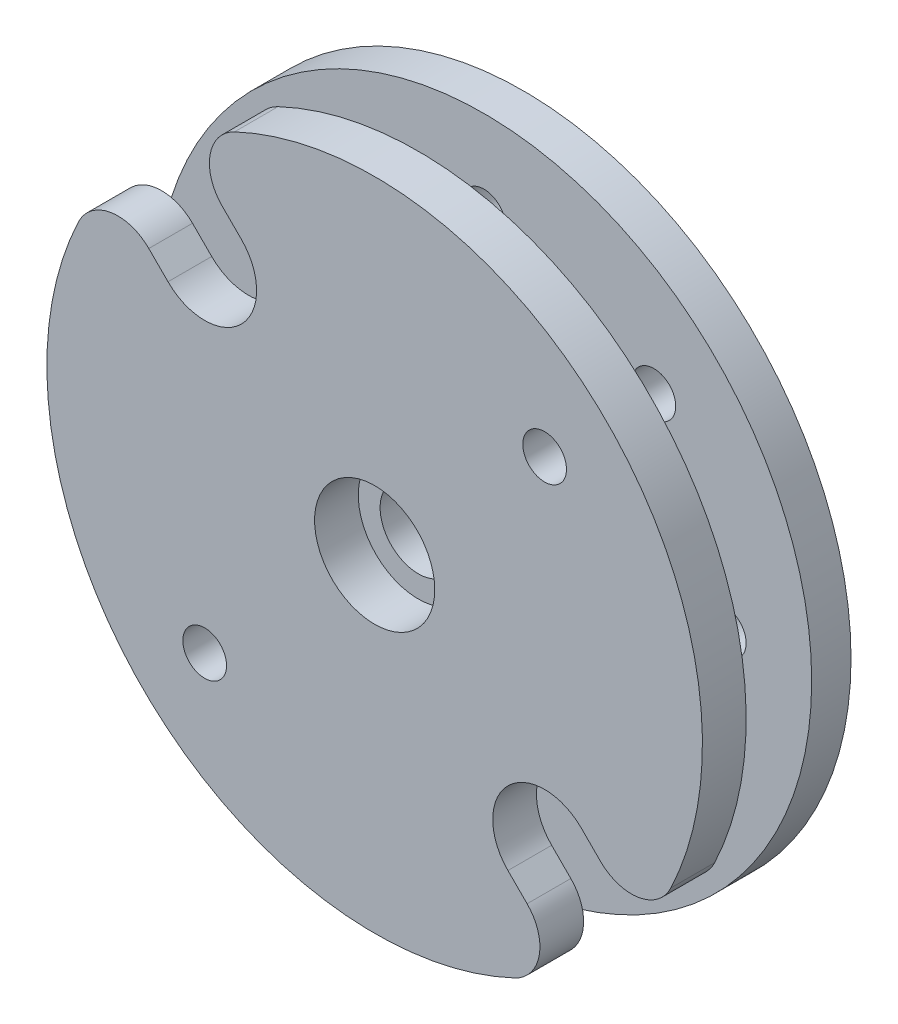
from build123d import *

# Parameters (mm, degrees)
SKETCH1_R           = 15
SKETCH1_R_2         = 5.25
SKETCH1_R_3         = 1
SKETCH1_R_4         = 2.25
BOSS_EXTRUDE1_DEPTH = 1.8
SKETCH2_R           = 6.25
SKETCH2_R_2         = 1.75
BOSS_EXTRUDE2_DEPTH = 3
SKETCH3_R           = 8.75
SKETCH3_R_2         = 2.75
BOSS_EXTRUDE3_DEPTH = 2
SKETCH4_R           = 2.375
CUT_EXTRUDE1_DEPTH  = 22.794494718
SKETCH5_R           = 15
SKETCH5_R_2         = 8.75
BOSS_EXTRUDE4_DEPTH = 2
CUT_EXTRUDE2_DEPTH  = 2
SKETCH8_R           = 1
CUT_EXTRUDE3_DEPTH  = 23.276444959
FILLET1_R           = 2
CHAMFER1_SIZE       = 0.75


with BuildPart() as part:
    # Sketch1 → Boss-Extrude1 (new body)
    with BuildSketch(Plane.XY):
        Circle(SKETCH1_R)
        Circle(SKETCH1_R_2, mode=Mode.SUBTRACT)
        with Locations((0, 11)):
            Circle(SKETCH1_R_3, mode=Mode.SUBTRACT)
        with Locations((7.778174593, 7.778174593)):
            Circle(SKETCH1_R_3, mode=Mode.SUBTRACT)
        with Locations((11, 0)):
            Circle(SKETCH1_R_3, mode=Mode.SUBTRACT)
        with Locations((7.778174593, -7.778174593)):
            Circle(SKETCH1_R_3, mode=Mode.SUBTRACT)
        with Locations((0, -11)):
            Circle(SKETCH1_R_3, mode=Mode.SUBTRACT)
        with Locations((-7.778174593, -7.778174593)):
            Circle(SKETCH1_R_3, mode=Mode.SUBTRACT)
        with Locations((-11, 0)):
            Circle(SKETCH1_R_3, mode=Mode.SUBTRACT)
        with Locations((-7.778174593, 7.778174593)):
            Circle(SKETCH1_R_4, mode=Mode.SUBTRACT)
    extrude(amount=-BOSS_EXTRUDE1_DEPTH)

    # Sketch2 → Boss-Extrude2 (add)
    with BuildSketch(Plane.XY):
        Circle(SKETCH2_R)
        Circle(SKETCH2_R_2, mode=Mode.SUBTRACT)
    extrude(amount=BOSS_EXTRUDE2_DEPTH)

    # Sketch3 → Boss-Extrude3 (add)
    with BuildSketch(Plane.XY.offset(3)):
        Circle(SKETCH3_R)
        Circle(SKETCH3_R_2, mode=Mode.SUBTRACT)
    extrude(amount=BOSS_EXTRUDE3_DEPTH)

    # Sketch4 → Cut-Extrude1 (cut, through all)
    with BuildSketch(Plane.XY):
        with Locations((7.778174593, -7.778174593)):
            Circle(SKETCH4_R)
        with Locations((-7.778174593, 7.778174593)):
            Circle(SKETCH4_R)
    extrude(amount=-CUT_EXTRUDE1_DEPTH, mode=Mode.SUBTRACT)

    # Sketch5 → Boss-Extrude4 (add)
    with BuildSketch(Plane.XY.offset(5)):
        Circle(SKETCH5_R)
        Circle(SKETCH5_R_2, mode=Mode.SUBTRACT)
    extrude(amount=-BOSS_EXTRUDE4_DEPTH)

    # Sketch6 → Cut-Extrude2 (cut)
    with BuildSketch(Plane.XY.offset(5)):
        with BuildLine():
            Line((-9.457553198, 6.098795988), (-12.152185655, 8.793428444))
            ThreePointArc((-12.152185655, 8.793428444), (-10.606601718, 10.606601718), (-8.793428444, 12.152185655))
            Line((-8.793428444, 12.152185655), (-6.098795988, 9.457553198))
            ThreePointArc((-6.098795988, 9.457553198), (-6.098795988, 6.098795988), (-9.457553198, 6.098795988))
        make_face()
        with BuildLine():
            Line((9.457553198, -6.098795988), (12.152185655, -8.793428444))
            ThreePointArc((12.152185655, -8.793428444), (10.606601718, -10.606601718), (8.793428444, -12.152185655))
            Line((8.793428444, -12.152185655), (6.098795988, -9.457553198))
            ThreePointArc((6.098795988, -9.457553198), (6.098795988, -6.098795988), (9.457553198, -6.098795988))
        make_face()
    extrude(amount=-CUT_EXTRUDE2_DEPTH, mode=Mode.SUBTRACT)

    # Sketch8 → Cut-Extrude3 (cut, through all)
    with BuildSketch(Plane(origin=(0, 0, -1.8), x_dir=(-1, 0, 0), z_dir=(0, 0, -1))):
        with Locations(Location((-7.778174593, 7.778174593, 0), (0, 0, 180))):
            Circle(SKETCH8_R)
        with Locations(Location((7.778174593, -7.778174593, 0), (0, 0, 180))):
            Circle(SKETCH8_R)
    extrude(amount=-CUT_EXTRUDE3_DEPTH, mode=Mode.SUBTRACT)

    # Fillet1
    fillet1_edges = [part.edges().sort_by_distance(p)[0] for p in [
        (12.152185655, -8.793428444, 4),
        (8.793428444, -12.152185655, 4),
        (-12.152185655, 8.793428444, 4),
        (-8.793428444, 12.152185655, 4),
    ]]
    fillet(fillet1_edges, radius=FILLET1_R)

    # Chamfer1
    chamfer1_edges = [part.edges().sort_by_distance(p)[0] for p in [
        (-6.25, 0, 3),
        (-6.25, 0, 0),
    ]]
    chamfer(chamfer1_edges, length=CHAMFER1_SIZE)


solid = part.part
